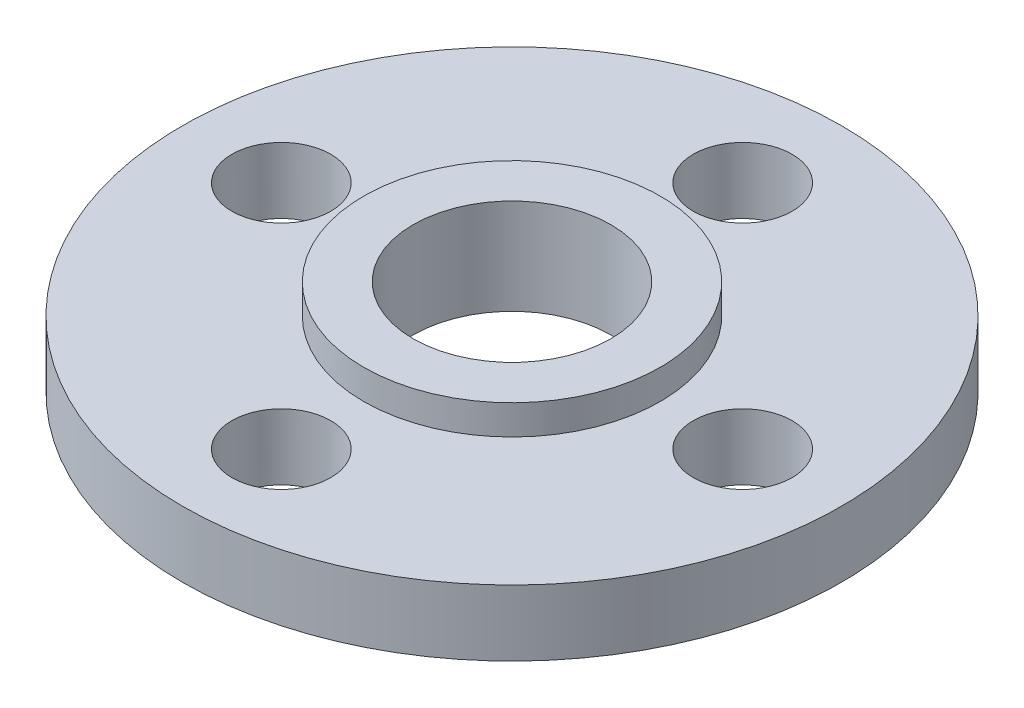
from build123d import *

# Parameters (mm, degrees)
SKETCH2_R           = 10
BOSS_EXTRUDE1_DEPTH = 2
SKETCH3_R           = 4.5
BOSS_EXTRUDE2_DEPTH = 0.9
SKETCH4_R           = 3
SKETCH4_R_2         = 1.5
CUT_EXTRUDE1_DEPTH  = 3.9


with BuildPart() as part:
    # Sketch2 → Boss-Extrude1 (new body)
    with BuildSketch(Plane(origin=(0, 0, 0), x_dir=(1, 0, 0), z_dir=(0, 1, 0))):
        with Locations(Location((0, 0, 0), (0, 0, 270))):
            Circle(SKETCH2_R)
    extrude(amount=BOSS_EXTRUDE1_DEPTH)

    # Sketch3 → Boss-Extrude2 (add)
    with BuildSketch(Plane(origin=(0, 2, 0), x_dir=(1, 0, 0), z_dir=(0, 1, 0))):
        with Locations(Location((0, 0, 0), (0, 0, 270))):
            Circle(SKETCH3_R)
    extrude(amount=BOSS_EXTRUDE2_DEPTH)

    # Sketch4 → Cut-Extrude1 (cut)
    with BuildSketch(Plane.XZ):
        with Locations(Location((0, 0, 0), (0, 0, 270))):
            Circle(SKETCH4_R)
        with Locations(Location((0, 7, 0), (0, 0, 270))):
            Circle(SKETCH4_R_2)
        with Locations(Location((7, 0, 0), (0, 0, 270))):
            Circle(SKETCH4_R_2)
        with Locations(Location((0, -7, 0), (0, 0, 270))):
            Circle(SKETCH4_R_2)
        with Locations(Location((-7, 0, 0), (0, 0, 270))):
            Circle(SKETCH4_R_2)
    extrude(amount=-CUT_EXTRUDE1_DEPTH, mode=Mode.SUBTRACT)


solid = part.part
